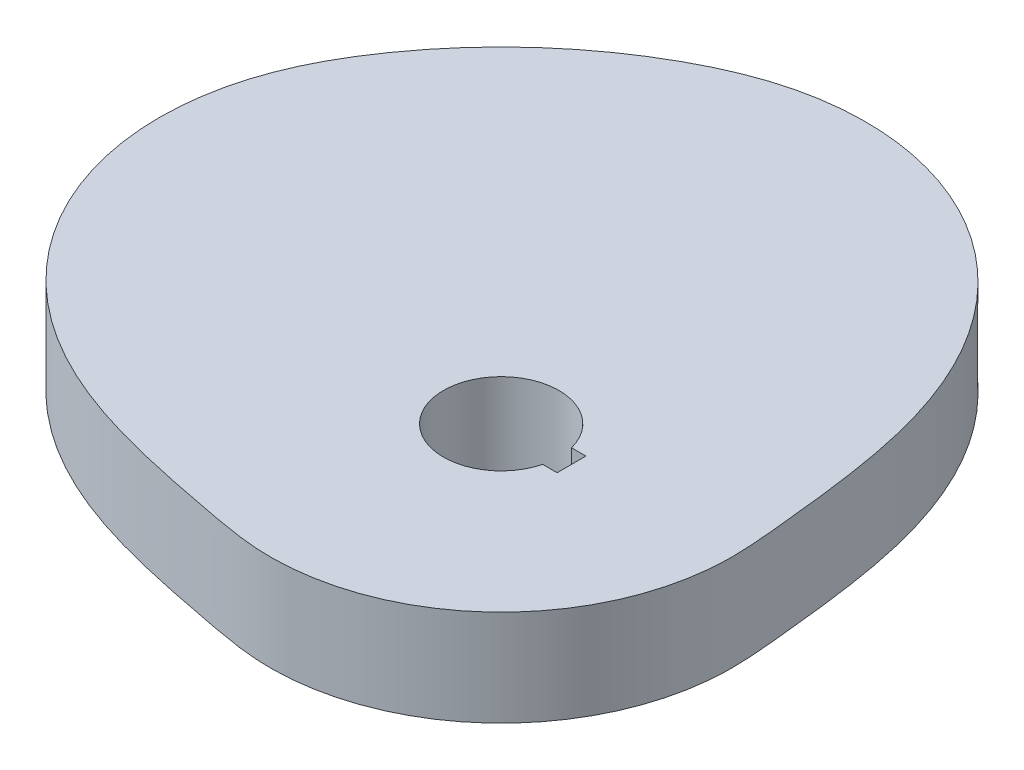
from build123d import *

# Parameters (mm, degrees)
SKETCH1_R                      = 153.67
SKETCH1_R_2                    = 19.0754
DISC_CW_INSIDE_ONCENTER_DEPTH  = 31.75
KEYWAY_0_3750_X_0_3750IN_DEPTH = 220.62923371
SINGLE_SURFACE_SKETCH_R        = 153.67
SINGLE_SURFACE_DEPTH           = 33.02


with BuildPart() as part:
    # Sketch1 → Disc_ CW_ Inside_ OnCenter (new body)
    with BuildSketch(Plane(origin=(0, 0, 0), x_dir=(1, 0, 0), z_dir=(0, 1, 0))):
        with Locations(Location((0, 0, 0), (0, 0, 270))):
            Circle(SKETCH1_R)
        with Locations(Location((0, 0, 0), (0, 0, 270))):
            Circle(SKETCH1_R_2, mode=Mode.SUBTRACT)
    extrude(amount=-DISC_CW_INSIDE_ONCENTER_DEPTH)

    # Sketch6 → Keyway_ 0.3750 x 0.3750in (cut, through all)
    with BuildSketch(Plane(origin=(0, 0, 0), x_dir=(1, 0, 0), z_dir=(0, 1, 0))):
        with BuildLine():
            Line((18.471315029, -4.7625), (23.233815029, -4.7625))
            Line((23.233815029, -4.7625), (23.233815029, 4.7625))
            Line((23.233815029, 4.7625), (18.471315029, 4.7625))
            ThreePointArc((18.471315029, 4.7625), (-19.0754, 0), (18.471315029, -4.7625))
        make_face()
    extrude(amount=-KEYWAY_0_3750_X_0_3750IN_DEPTH, mode=Mode.SUBTRACT)

    # Single Surface Sketch → Single Surface (cut)
    with BuildSketch(Plane(origin=(0, 0, 0), x_dir=(1, 0, 0), z_dir=(0, 1, 0))):
        Circle(SINGLE_SURFACE_SKETCH_R)
        with BuildLine():
            add(Edge.make_bspline(
                [(76.2, 0), (76.199996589, 0.496360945), (76.190566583, 1.459334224), (76.152941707, 2.902764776), (76.095407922, 4.344021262), (76.018170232, 5.826077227), (75.922756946, 7.347310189), (75.810840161, 8.905762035), (75.684184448, 10.499145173), (75.544592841, 12.124850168), (75.393848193, 13.779960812), (75.233647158, 15.461276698), (75.0655567, 17.16534763), (74.890892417, 18.888508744), (74.710917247, 20.626957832), (74.52402447, 22.39412935), (74.336550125, 24.151766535), (74.143091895, 25.914340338), (73.947782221, 27.663507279), (73.745487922, 29.433816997), (73.537802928, 31.207932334), (73.324068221, 32.985887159), (73.103634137, 34.767742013), (72.875778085, 36.553573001), (72.639731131, 38.343471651), (72.394675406, 40.137540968), (72.139749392, 41.935891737), (71.874051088, 43.738638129), (71.596641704, 45.545892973), (71.30654915, 47.357762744), (71.00277151, 49.174342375), (70.684280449, 50.995709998), (70.350024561, 52.821921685), (69.998932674, 54.653006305), (69.629917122, 56.488960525), (69.241876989, 58.329744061), (68.83370134, 60.175275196), (68.404272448, 62.02542663), (67.952469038, 63.880021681), (67.477169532, 65.738830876), (66.977255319, 67.60156893), (66.451614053, 69.467892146), (65.899142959, 71.337396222), (65.318752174, 73.209614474), (64.709368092, 75.084016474), (64.069936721, 76.96000709), (63.399427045, 78.836925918), (62.696834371, 80.7140471), (61.96118366, 82.590579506), (61.191532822, 84.465667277), (60.386975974, 86.338390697), (59.546646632, 88.207767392), (58.669720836, 90.072753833), (57.755420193, 91.932247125), (56.803014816, 93.785087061), (55.81182616, 95.63005844), (54.781229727, 97.465893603), (53.710657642, 99.291275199), (52.599601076, 101.104839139), (51.447612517, 102.905177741), (50.254307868, 104.690843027), (49.019368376, 106.460350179), (47.742542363, 108.212181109), (46.423646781, 109.944788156), (45.062568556, 111.656597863), (43.659265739, 113.346014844), (42.213768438, 115.011425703), (40.726179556, 116.651203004), (39.196675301, 118.263709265), (37.625505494, 119.847300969), (36.012993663, 121.400332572), (34.359536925, 122.921160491), (32.665605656, 124.408147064), (30.931742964, 125.859664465), (29.158563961, 127.274098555), (27.346754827, 128.64985267), (25.497071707, 129.985351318), (23.610339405, 131.279043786), (21.68744992, 132.52940764), (19.729360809, 133.734952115), (17.737093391, 134.894221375), (15.711730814, 136.005797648), (13.654415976, 137.068304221), (11.566349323, 138.080408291), (9.448786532, 139.040823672), (7.303036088, 139.948313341), (5.130456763, 140.80169184), (2.932455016, 141.599827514), (0.710482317, 142.341644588), (-1.533967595, 143.026125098), (-3.799361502, 143.652310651), (-6.084129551, 144.219304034), (-8.386668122, 144.726270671), (-10.705342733, 145.172439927), (-13.038490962, 145.55710626), (-15.384425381, 145.879630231), (-17.741436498, 146.13943938), (-20.107795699, 146.336028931), (-22.4817582, 146.46896248), (-24.861565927, 146.537872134), (-27.245450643, 146.542460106), (-29.631636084, 146.48249424), (-32.018343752, 146.357825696), (-34.403784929, 146.168323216), (-36.786204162, 145.914118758), (-39.174057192, 145.593300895), (-41.545401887, 145.210462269), (-43.909089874, 144.761208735), (-46.255282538, 144.250356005), (-48.604610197, 143.67242754), (-50.947523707, 143.029888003), (-53.284590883, 142.322888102), (-55.616373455, 141.551760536), (-57.943405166, 140.716956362), (-60.266188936, 139.819075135), (-62.585191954, 138.858868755), (-64.900844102, 137.837250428), (-67.213537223, 136.755299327), (-69.523626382, 135.614262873), (-71.831426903, 134.415555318), (-74.059371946, 133.203121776), (-76.360239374, 131.898553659), (-78.648162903, 130.548188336), (-80.989254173, 129.107935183), (-83.230164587, 127.674814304), (-85.44572063, 126.20280208), (-87.635249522, 124.692347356), (-89.79808375, 123.14391011), (-91.933564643, 121.557962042), (-94.041041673, 119.93498624), (-96.119872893, 118.27547708), (-98.169425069, 116.579940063), (-100.189073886, 114.848891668), (-102.178204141, 113.082859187), (-104.136209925, 111.282380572), (-106.062494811, 109.448004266), (-107.956472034, 107.580289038), (-109.817564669, 105.679803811), (-111.64520581, 103.747127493), (-113.438838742, 101.782848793), (-115.197917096, 99.787566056), (-116.921905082, 97.761887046), (-118.610277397, 95.706428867), (-120.262520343, 93.621817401), (-121.878128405, 91.5086885), (-123.404002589, 89.439047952), (-124.943852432, 87.27624968), (-126.438386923, 85.097929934), (-127.927106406, 82.834830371), (-129.311059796, 80.638857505), (-130.637469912, 78.435494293), (-131.904990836, 76.224296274), (-133.112444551, 74.004797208), (-134.25882421, 71.776507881), (-135.343291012, 69.5389159), (-136.36516752, 67.291485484), (-137.323934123, 65.033660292), (-138.219202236, 62.764862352), (-139.050766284, 60.484515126), (-139.818359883, 58.191988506), (-140.519477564, 55.896771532), (-141.158656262, 53.57817028), (-141.735562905, 51.247130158), (-142.249983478, 48.8939949), (-142.698128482, 46.54094881), (-143.081903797, 44.179570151), (-143.401222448, 41.811645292), (-143.656023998, 39.438956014), (-143.846328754, 37.063290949), (-143.972223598, 34.686438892), (-144.033865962, 32.310186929), (-144.031482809, 29.936317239), (-143.96537079, 27.566604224), (-143.835895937, 25.202811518), (-143.643493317, 22.846689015), (-143.388666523, 20.499969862), (-143.071987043, 18.164367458), (-142.69409348, 15.841572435), (-142.255690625, 13.533249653), (-141.757548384, 11.241035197), (-141.200500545, 8.966533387), (-140.585443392, 6.71131382), (-139.913334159, 4.476908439), (-139.185189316, 2.264808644), (-138.402082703, 0.076462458), (-137.565143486, -2.08672825), (-136.67555396, -4.223410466), (-135.734547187, -6.33228265), (-134.74340447, -8.412097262), (-133.703452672, -10.46166318), (-132.616061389, -12.47984801), (-131.48263996, -14.46558026), (-130.304634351, -16.41785138), (-129.083523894, -18.335717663), (-127.820817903, -20.218301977), (-126.518052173, -22.064795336), (-125.17678537, -23.874458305), (-123.798595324, -25.646622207), (-122.385075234, -27.380690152), (-120.937829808, -29.076137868), (-119.45847133, -30.732514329), (-117.948615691, -32.349442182), (-116.409878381, -33.926617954), (-114.843870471, -35.463812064), (-113.252194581, -36.960868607), (-111.63644087, -38.417704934), (-109.998183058, -39.834311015), (-108.338974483, -41.21074859), (-106.660344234, -42.547150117), (-104.963793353, -43.843717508), (-103.250791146, -45.100720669), (-101.522771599, -46.31849585), (-99.781129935, -47.497443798), (-98.02721932, -48.638027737), (-96.26234774, -49.74077118), (-94.487775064, -50.806255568), (-92.70471032, -51.835117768), (-90.914309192, -52.828047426), (-89.117671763, -53.785784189), (-87.315840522, -54.709114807), (-85.509798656, -55.598870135), (-83.700468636, -56.455922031), (-81.888711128, -57.281180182), (-80.075324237, -58.075588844), (-78.261043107, -58.840123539), (-76.446539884, -59.575787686), (-74.632424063, -60.283609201), (-72.81924324, -60.964637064), (-71.007484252, -61.619937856), (-69.197574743, -62.250592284), (-67.389885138, -62.857691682), (-65.584731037, -63.442334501), (-63.782376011, -64.005622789), (-61.983034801, -64.548658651), (-60.186876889, -65.072540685), (-58.394030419, -65.578360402), (-56.604586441, -66.067198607), (-54.818603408, -66.540121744), (-53.036111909, -66.998178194), (-51.257119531, -67.442394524), (-49.481615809, -67.87377168), (-47.709577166, -68.29328112), (-45.940971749, -68.70186092), (-44.175764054, -69.10041174), (-42.413919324, -69.489793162), (-40.655407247, -69.870818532), (-38.900206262, -70.244255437), (-37.148303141, -70.610805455), (-35.399707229, -70.97116136), (-33.654406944, -71.325777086), (-31.929658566, -71.67226716), (-30.191140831, -72.016060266), (-28.458063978, -72.356708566), (-26.715711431, -72.695433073), (-25.002230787, -73.025104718), (-23.304242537, -73.347745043), (-21.625427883, -73.661893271), (-19.969272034, -73.965831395), (-18.339028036, -74.257681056), (-16.737679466, -74.535453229), (-15.167915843, -74.797114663), (-13.632116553, -75.04065012), (-12.132342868, -75.264122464), (-10.670334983, -75.465725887), (-9.247514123, -75.643834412), (-7.909090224, -75.792142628), (-6.55906277, -75.921136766), (-5.227279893, -76.024770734), (-3.855378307, -76.106279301), (-2.526552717, -76.161972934), (-1.196958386, -76.194467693), (0.133000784, -76.203752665), (1.462919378, -76.189825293), (2.792392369, -76.152689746), (4.121014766, -76.092357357), (5.448381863, -76.008846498), (6.77408933, -75.902182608), (8.097733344, -75.772398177), (9.41891071, -75.619532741), (10.737218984, -75.443632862), (12.052256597, -75.244752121), (13.363622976, -75.0229511), (14.670918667, -74.778297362), (15.973745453, -74.51086543), (17.271706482, -74.220736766), (18.564406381, -73.907999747), (19.851451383, -73.572749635), (21.13244944, -73.215088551), (22.407010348, -72.835125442), (23.674745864, -72.432976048), (24.935269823, -72.008762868), (26.188198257, -71.562615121), (27.433149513, -71.094668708), (28.669744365, -70.60506617), (29.897606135, -70.093956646), (31.116360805, -69.561495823), (32.32563713, -69.007845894), (33.525066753, -68.433175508), (34.714284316, -67.837659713), (35.892927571, -67.22147991), (37.060637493, -66.584823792), (38.217058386, -65.927885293), (39.361837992, -65.250864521), (40.494627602, -64.553967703), (41.615082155, -63.837407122), (42.722860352, -63.101401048), (43.817624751, -62.346173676), (44.899041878, -61.571955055), (45.966782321, -60.778981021), (47.020520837, -59.96749312), (48.059936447, -59.13773854), (49.084712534, -58.289970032), (50.094536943, -57.424445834), (51.089102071, -56.541429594), (52.068104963, -55.641190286), (53.031247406, -54.724002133), (53.978236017, -53.790144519), (54.908782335, -52.839901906), (55.822602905, -51.873563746), (56.71941937, -50.891424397), (57.598958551, -49.893783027), (58.46095253, -48.880943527), (59.305138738, -47.853214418), (60.131260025, -46.810908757), (60.939064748, -45.754344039), (61.728306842, -44.683842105), (62.498745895, -43.59972904), (63.250147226, -42.502335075), (63.982281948, -41.391994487), (64.694927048, -40.269045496), (65.387865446, -39.133830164), (66.060886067, -37.986694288), (66.713783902, -36.827987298), (67.346360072, -35.658062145), (67.958421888, -34.477275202), (68.549782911, -33.285986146), (69.120263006, -32.084557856), (69.669688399, -30.8733563), (70.19789173, -29.65275042), (70.704712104, -28.423112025), (71.189995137, -27.184815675), (71.653593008, -25.938238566), (72.0953645, -24.683760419), (72.515175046, -23.421763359), (72.912896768, -22.152631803), (73.288408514, -20.876752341), (73.641595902, -19.594513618), (73.972351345, -18.306306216), (74.280574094, -17.012522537), (74.566170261, -15.713556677), (74.82905285, -14.409804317), (75.069141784, -13.10166259), (75.286363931, -11.78952997), (75.480653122, -10.473806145), (75.651950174, -9.154891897), (75.800202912, -7.833188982), (75.925366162, -6.509099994), (76.027401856, -5.183028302), (76.106278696, -3.855377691), (76.161973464, -2.526553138), (76.193383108, -1.241276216), (76.200002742, -0.398982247), (76.2, 0)],
                knots=[0, 0, 0, 0, 0.002132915, 0.004137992, 0.006204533, 0.008330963, 0.010515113, 0.012754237, 0.01504503, 0.017383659, 0.0197658, 0.022186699, 0.024641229, 0.027123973, 0.029629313, 0.032151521, 0.034760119, 0.037224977, 0.039771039, 0.042323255, 0.044881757, 0.047446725, 0.050018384, 0.052597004, 0.055182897, 0.057776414, 0.060377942, 0.062987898, 0.065606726, 0.068234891, 0.070872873, 0.073521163, 0.076180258, 0.078850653, 0.081532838, 0.084227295, 0.086934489, 0.089654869, 0.092388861, 0.095136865, 0.097899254, 0.100676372, 0.103468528, 0.106275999, 0.109099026, 0.111937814, 0.114792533, 0.117663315, 0.120550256, 0.123453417, 0.126372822, 0.129308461, 0.13226029, 0.135228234, 0.138212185, 0.141212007, 0.144227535, 0.147258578, 0.150304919, 0.153366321, 0.156442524, 0.159533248, 0.162638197, 0.16575706, 0.168889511, 0.172035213, 0.17519382, 0.178364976, 0.181548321, 0.184743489, 0.187950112, 0.191167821, 0.194396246, 0.197635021, 0.200883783, 0.204142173, 0.207409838, 0.210686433, 0.213971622, 0.217265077, 0.220566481, 0.22387553, 0.227191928, 0.230515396, 0.233845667, 0.237182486, 0.240525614, 0.243874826, 0.247229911, 0.250590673, 0.253956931, 0.257328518, 0.26070528, 0.26408708, 0.267473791, 0.270865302, 0.274261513, 0.277662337, 0.281067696, 0.284477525, 0.287891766, 0.291310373, 0.294733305, 0.298160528, 0.301592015, 0.305027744, 0.308512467, 0.311912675, 0.315365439, 0.318829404, 0.322307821, 0.325803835, 0.329320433, 0.33286041, 0.336426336, 0.34002052, 0.343644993, 0.347301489, 0.350991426, 0.354715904, 0.358475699, 0.361890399, 0.3660813, 0.36989122, 0.373701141, 0.377511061, 0.381320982, 0.385130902, 0.388940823, 0.392750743, 0.396560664, 0.400370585, 0.404180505, 0.407990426, 0.411800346, 0.415610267, 0.419420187, 0.423230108, 0.427040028, 0.430849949, 0.434659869, 0.43846979, 0.44227971, 0.446089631, 0.449899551, 0.453709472, 0.457138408, 0.461307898, 0.465060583, 0.46877808, 0.472461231, 0.476111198, 0.479729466, 0.483317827, 0.486878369, 0.490413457, 0.493925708, 0.497417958, 0.500893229, 0.50435469, 0.507805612, 0.511204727, 0.514688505, 0.518123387, 0.521554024, 0.524980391, 0.52840246, 0.531820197, 0.53523356, 0.5386425, 0.542046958, 0.545446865, 0.548842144, 0.552232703, 0.555618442, 0.558999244, 0.562374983, 0.565745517, 0.569110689, 0.572470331, 0.575824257, 0.57917227, 0.582514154, 0.585849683, 0.589178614, 0.592500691, 0.595815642, 0.599123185, 0.602423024, 0.605714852, 0.608998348, 0.612273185, 0.615539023, 0.618795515, 0.622042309, 0.625279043, 0.628505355, 0.631720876, 0.634925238, 0.638118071, 0.641299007, 0.644467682, 0.647623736, 0.650766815, 0.653896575, 0.657012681, 0.66011481, 0.663202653, 0.666275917, 0.669334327, 0.672377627, 0.675405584, 0.678417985, 0.681414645, 0.684395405, 0.687360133, 0.690308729, 0.693241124, 0.69615728, 0.699057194, 0.701940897, 0.704808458, 0.707659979, 0.710495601, 0.713315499, 0.716119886, 0.718909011, 0.721683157, 0.724442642, 0.727187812, 0.729919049, 0.732636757, 0.735341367, 0.738033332, 0.74071312, 0.743381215, 0.74603811, 0.748684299, 0.751320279, 0.753946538, 0.756563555, 0.759171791, 0.761771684, 0.764363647, 0.766948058, 0.769525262, 0.772095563, 0.774659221, 0.777216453, 0.779767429, 0.782312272, 0.78477602, 0.787382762, 0.789902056, 0.792403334, 0.79488088, 0.797329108, 0.799742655, 0.802116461, 0.804445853, 0.806726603, 0.808954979, 0.811127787, 0.813242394, 0.815296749, 0.817289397, 0.819028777, 0.821124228, 0.823029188, 0.824934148, 0.826839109, 0.828744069, 0.830649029, 0.832553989, 0.83445895, 0.83636391, 0.83826887, 0.84017383, 0.842078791, 0.843983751, 0.845888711, 0.847793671, 0.849698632, 0.851603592, 0.853508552, 0.855413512, 0.857318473, 0.859223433, 0.861128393, 0.863033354, 0.864938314, 0.866843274, 0.868748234, 0.870653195, 0.872558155, 0.874463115, 0.876368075, 0.878273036, 0.880177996, 0.882082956, 0.883987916, 0.885892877, 0.887797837, 0.889702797, 0.891607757, 0.893512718, 0.895417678, 0.897322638, 0.899227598, 0.901132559, 0.903037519, 0.904942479, 0.906847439, 0.9087524, 0.91065736, 0.91256232, 0.91446728, 0.916372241, 0.918277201, 0.920182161, 0.922087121, 0.923992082, 0.925897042, 0.927802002, 0.929706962, 0.931611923, 0.933516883, 0.935421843, 0.937326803, 0.939231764, 0.941136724, 0.943041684, 0.944946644, 0.946851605, 0.948756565, 0.950661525, 0.952566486, 0.954471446, 0.956376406, 0.958281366, 0.960186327, 0.962091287, 0.963996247, 0.965901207, 0.967806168, 0.969711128, 0.971616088, 0.973521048, 0.975426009, 0.977330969, 0.979235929, 0.981140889, 0.98304585, 0.98495081, 0.98685577, 0.98876073, 0.990665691, 0.992570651, 0.994475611, 0.996380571, 0.998285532, 1, 1, 1, 1], degree=3))
        make_face(mode=Mode.SUBTRACT)
    extrude(amount=-SINGLE_SURFACE_DEPTH, mode=Mode.SUBTRACT)


solid = part.part
